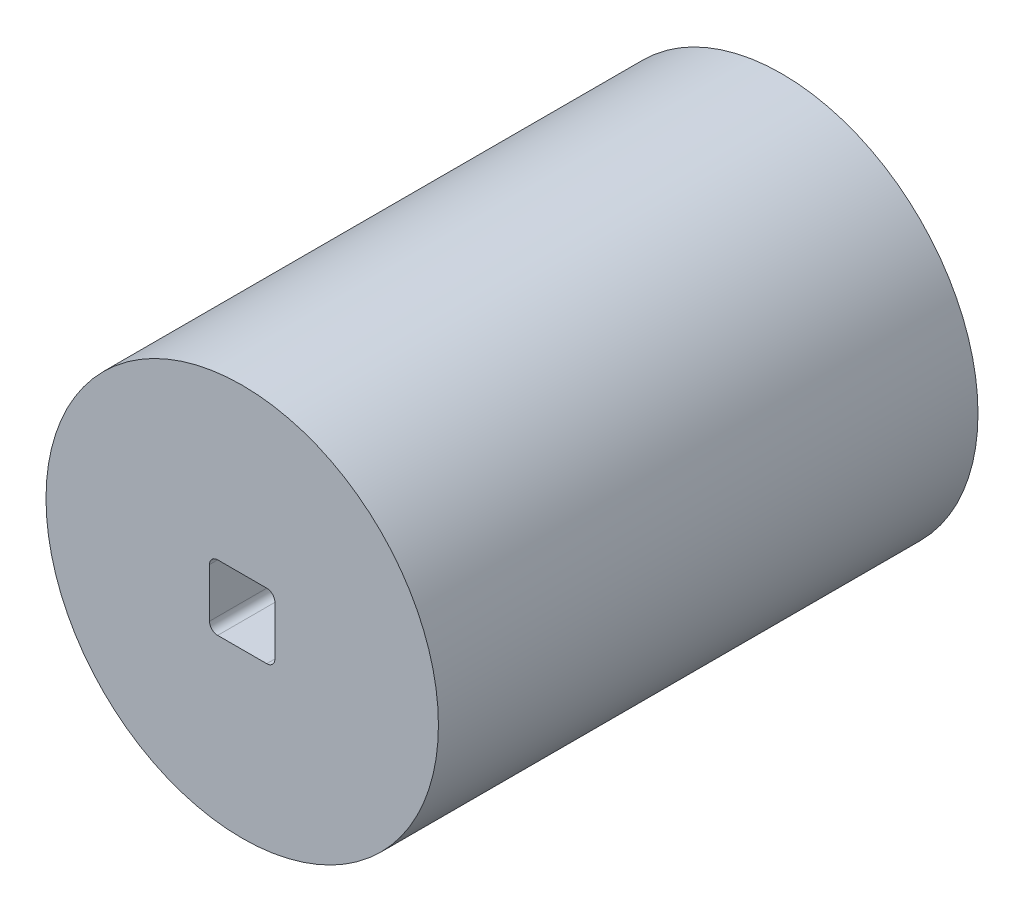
from build123d import *

# Parameters (mm, degrees)
SKETCH1_R           = 609.6
BOSS_EXTRUDE1_DEPTH = 1676.4
CUT_EXTRUDE1_DEPTH  = 1625.6
CUT_EXTRUDE2_DEPTH  = 19.05
CUT_EXTRUDE3_DEPTH  = 19.05


with BuildPart() as part:
    # Sketch1 → Boss-Extrude1 (new body)
    with BuildSketch(Plane(origin=(0, 0, 0), x_dir=(0, 1, 0), z_dir=(0, 0, 1))):
        with Locations(Location((0, 0, 0), (0, 0, 270))):
            Circle(SKETCH1_R)
    extrude(amount=-BOSS_EXTRUDE1_DEPTH)

    # Sketch3 → Cut-Extrude1 (cut)
    # profile 1 of 2: a face of its own
    with BuildSketch(Plane(origin=(0, 0, 0), x_dir=(0, 1, 0), z_dir=(0, 0, 1))):
        with BuildLine():
            Line((76.2, 101.6), (-76.2, 101.6))
            ThreePointArc((-76.2, 101.6), (-94.160512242, 94.160512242), (-101.6, 76.2))
            Line((-101.6, 76.2), (-101.6, -76.2))
            ThreePointArc((-101.6, -76.2), (-94.160512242, -94.160512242), (-76.2, -101.6))
            Line((-76.2, -101.6), (76.2, -101.6))
            ThreePointArc((76.2, -101.6), (94.160512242, -94.160512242), (101.6, -76.2))
            Line((101.6, -76.2), (101.6, 76.2))
            ThreePointArc((101.6, 76.2), (94.160512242, 94.160512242), (76.2, 101.6))
        make_face()
        with BuildLine():
            ThreePointArc((-88.9, -76.2), (-85.180256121, -85.180256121), (-76.2, -88.9))
            Line((-76.2, -88.9), (76.2, -88.9))
            ThreePointArc((76.2, -88.9), (85.180256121, -85.180256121), (88.9, -76.2))
            Line((88.9, -76.2), (88.9, 76.2))
            ThreePointArc((88.9, 76.2), (85.180256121, 85.180256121), (76.2, 88.9))
            Line((76.2, 88.9), (-76.2, 88.9))
            ThreePointArc((-76.2, 88.9), (-85.180256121, 85.180256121), (-88.9, 76.2))
            Line((-88.9, 76.2), (-88.9, -76.2))
        make_face(mode=Mode.SUBTRACT)
    # profile 2 of 2: a face of its own
    with BuildSketch(Plane(origin=(0, 0, 0), x_dir=(0, 1, 0), z_dir=(0, 0, 1))):
        with BuildLine():
            Line((-88.9, -76.2), (-88.9, 76.2))
            ThreePointArc((-88.9, 76.2), (-85.180256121, 85.180256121), (-76.2, 88.9))
            Line((-76.2, 88.9), (76.2, 88.9))
            ThreePointArc((76.2, 88.9), (85.180256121, 85.180256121), (88.9, 76.2))
            Line((88.9, 76.2), (88.9, -76.2))
            ThreePointArc((88.9, -76.2), (85.180256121, -85.180256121), (76.2, -88.9))
            Line((76.2, -88.9), (-76.2, -88.9))
            ThreePointArc((-76.2, -88.9), (-85.180256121, -85.180256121), (-88.9, -76.2))
        make_face()
    extrude(amount=-CUT_EXTRUDE1_DEPTH, mode=Mode.SUBTRACT)

    # Sketch4 → Cut-Extrude2 (cut)
    with BuildSketch(Plane(origin=(0, 0, -1635.125), x_dir=(0, -1, 0), z_dir=(0, 0, 1))):
        Polygon((131.982271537, -228.6), (263.964543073, 0), (131.982271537, 228.6), (-131.982271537, 228.6), (-263.964543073, 0), (-131.982271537, -228.6), align=None)
    extrude(amount=CUT_EXTRUDE2_DEPTH, mode=Mode.SUBTRACT)

    # Sketch5 → Cut-Extrude3 (cut)
    with BuildSketch(Plane(origin=(0, 0, -1635.125), x_dir=(0, 1, 0), z_dir=(0, 0, 1))):
        Polygon((263.964543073, -457.2), (527.929086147, 0), (263.964543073, 457.2), (-263.964543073, 457.2), (-527.929086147, 0), (-263.964543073, -457.2), align=None)
    extrude(amount=CUT_EXTRUDE3_DEPTH, mode=Mode.SUBTRACT)


solid = part.part
